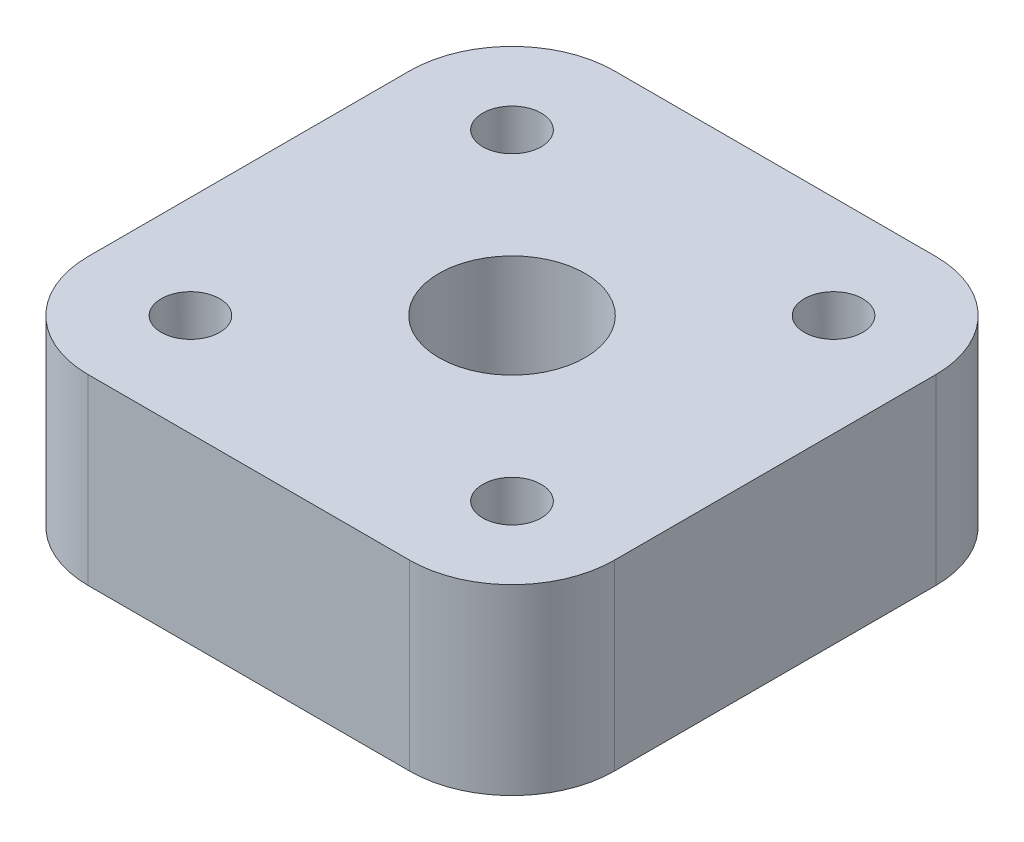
from build123d import *

# Parameters (mm, degrees)
SKETCH1_W           = 36
SKETCH1_H           = 36
SKETCH1_R           = 5
SKETCH1_R_2         = 2
BOSS_EXTRUDE1_DEPTH = 6.25
FILLET1_R           = 7
SKETCH2_R           = 3.5
CUT_EXTRUDE1_DEPTH  = 4


with BuildPart() as part:
    # Sketch1 → Boss-Extrude1 (new, symmetric)
    with BuildSketch(Plane(origin=(0, 0, 0), x_dir=(1, 0, 0), z_dir=(0, 1, 0))):
        Rectangle(SKETCH1_W, SKETCH1_H)
        with Locations(Location((0, 0, 0), (0, 0, 270))):
            Circle(SKETCH1_R, mode=Mode.SUBTRACT)
        with Locations(Location((11, -11, 0), (0, 0, 270))):
            Circle(SKETCH1_R_2, mode=Mode.SUBTRACT)
        with Locations(Location((11, 11, 0), (0, 0, 270))):
            Circle(SKETCH1_R_2, mode=Mode.SUBTRACT)
        with Locations(Location((-11, 11, 0), (0, 0, 270))):
            Circle(SKETCH1_R_2, mode=Mode.SUBTRACT)
        with Locations(Location((-11, -11, 0), (0, 0, 270))):
            Circle(SKETCH1_R_2, mode=Mode.SUBTRACT)
    extrude(amount=BOSS_EXTRUDE1_DEPTH, both=True)

    # Fillet1
    fillet1_edges = [part.edges().sort_by_distance(p)[0] for p in [
        (18, 0, 18),
        (-18, 0, 18),
        (-18, 0, -18),
        (18, 0, -18),
    ]]
    fillet(fillet1_edges, radius=FILLET1_R)

    # Sketch2 → Cut-Extrude1 (cut)
    with BuildSketch(Plane.XZ.offset(6.25)):
        with Locations(Location((-11, 11, 0), (0, 0, 270))):
            Circle(SKETCH2_R)
        with Locations(Location((11, 11, 0), (0, 0, 270))):
            Circle(SKETCH2_R)
        with Locations(Location((-11, -11, 0), (0, 0, 270))):
            Circle(SKETCH2_R)
        with Locations(Location((11, -11, 0), (0, 0, 270))):
            Circle(SKETCH2_R)
    extrude(amount=-CUT_EXTRUDE1_DEPTH, mode=Mode.SUBTRACT)


solid = part.part
